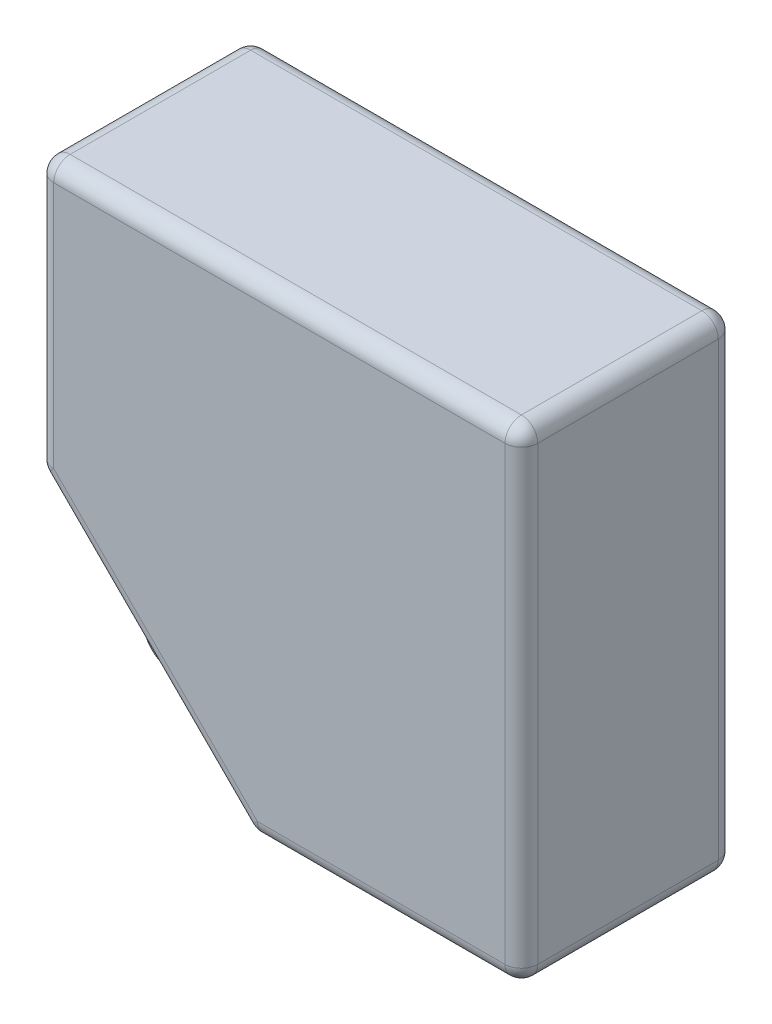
ISO-10303-21;
HEADER;
FILE_DESCRIPTION(('STEP AP214'),'2;1');
FILE_NAME('part.step','',(''),(''),'','','');
FILE_SCHEMA(('AUTOMOTIVE_DESIGN { 1 0 10303 214 1 1 1 1 }'));
ENDSEC;
DATA;
#1=APPLICATION_CONTEXT('core data for automotive mechanical design processes');
#2=APPLICATION_PROTOCOL_DEFINITION('international standard','automotive_design',2000,#1);
#3=PRODUCT_CONTEXT('',#1,'mechanical');
#4=PRODUCT('Part','Part','',(#3));
#5=PRODUCT_RELATED_PRODUCT_CATEGORY('part','',(#4));
#6=PRODUCT_DEFINITION_FORMATION('','',#4);
#7=PRODUCT_DEFINITION_CONTEXT('part definition',#1,'design');
#8=PRODUCT_DEFINITION('design','',#6,#7);
#9=PRODUCT_DEFINITION_SHAPE('','',#8);
#10=(LENGTH_UNIT() NAMED_UNIT(*) SI_UNIT(.MILLI.,.METRE.));
#11=(NAMED_UNIT(*) PLANE_ANGLE_UNIT() SI_UNIT($,.RADIAN.));
#12=(NAMED_UNIT(*) SI_UNIT($,.STERADIAN.) SOLID_ANGLE_UNIT());
#13=UNCERTAINTY_MEASURE_WITH_UNIT(LENGTH_MEASURE(1.E-05),#10,'distance_accuracy_value','');
#14=(GEOMETRIC_REPRESENTATION_CONTEXT(3) GLOBAL_UNCERTAINTY_ASSIGNED_CONTEXT((#13)) GLOBAL_UNIT_ASSIGNED_CONTEXT((#10,
#11,#12)) REPRESENTATION_CONTEXT('',''));
#15=CARTESIAN_POINT('',(0.,0.,0.));
#16=DIRECTION('',(0.,0.,1.));
#17=DIRECTION('',(1.,0.,0.));
#18=AXIS2_PLACEMENT_3D('',#15,#16,#17);
#19=CARTESIAN_POINT('',(-25.3737441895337,-32.5792172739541,26.));
#20=DIRECTION('',(0.707106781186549,0.707106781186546,0.));
#21=DIRECTION('',(-0.707106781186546,0.707106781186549,0.));
#22=AXIS2_PLACEMENT_3D('',#19,#20,#21);
#23=PLANE('',#22);
#24=DIRECTION('',(0.707106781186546,-0.707106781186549,0.));
#25=VECTOR('',#24,1.);
#26=CARTESIAN_POINT('',(-51.3737441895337,-6.57921727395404,24.));
#27=LINE('',#26,#25);
#28=CARTESIAN_POINT('',(-25.9595306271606,-31.9934308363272,24.));
#29=VERTEX_POINT('',#28);
#30=CARTESIAN_POINT('',(-50.7879577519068,-7.16500371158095,24.));
#31=VERTEX_POINT('',#30);
#32=EDGE_CURVE('E203',#29,#31,#27,.F.);
#33=ORIENTED_EDGE('',*,*,#32,.T.);
#34=DIRECTION('',(0.,0.,1.));
#35=VECTOR('',#34,1.);
#36=CARTESIAN_POINT('',(-50.7879577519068,-7.16500371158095,0.));
#37=LINE('',#36,#35);
#38=CARTESIAN_POINT('',(-50.7879577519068,-7.16500371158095,2.));
#39=VERTEX_POINT('',#38);
#40=EDGE_CURVE('E205',#31,#39,#37,.F.);
#41=ORIENTED_EDGE('',*,*,#40,.T.);
#42=DIRECTION('',(-0.707106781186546,0.707106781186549,0.));
#43=VECTOR('',#42,1.);
#44=CARTESIAN_POINT('',(-25.3737441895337,-32.5792172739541,2.));
#45=LINE('',#44,#43);
#46=CARTESIAN_POINT('',(-25.9595306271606,-31.9934308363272,2.));
#47=VERTEX_POINT('',#46);
#48=EDGE_CURVE('E199',#39,#47,#45,.F.);
#49=ORIENTED_EDGE('',*,*,#48,.T.);
#50=DIRECTION('',(0.,0.,-1.));
#51=VECTOR('',#50,1.);
#52=CARTESIAN_POINT('',(-25.9595306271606,-31.9934308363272,26.));
#53=LINE('',#52,#51);
#54=EDGE_CURVE('E201',#47,#29,#53,.F.);
#55=ORIENTED_EDGE('',*,*,#54,.T.);
#56=EDGE_LOOP('',(#33,#41,#49,#55));
#57=FACE_BOUND('',#56,.T.);
#58=CARTESIAN_POINT('',(-38.2368123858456,-19.7161490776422,13.0014424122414));
#59=DIRECTION('',(-0.707106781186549,-0.707106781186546,0.));
#60=DIRECTION('',(0.707106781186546,-0.707106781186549,0.));
#61=AXIS2_PLACEMENT_3D('',#58,#59,#60);
#62=CIRCLE('',#61,5.1);
#63=CARTESIAN_POINT('',(-34.6305678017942,-23.3223936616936,13.0014424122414));
#64=VERTEX_POINT('',#63);
#65=EDGE_CURVE('E589',#64,#64,#62,.T.);
#66=ORIENTED_EDGE('',*,*,#65,.F.);
#67=EDGE_LOOP('',(#66));
#68=FACE_BOUND('',#67,.T.);
#69=ADVANCED_FACE('F29',(#57,#68),#23,.F.);
#70=CARTESIAN_POINT('',(-51.3737441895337,-32.5792172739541,26.));
#71=DIRECTION('',(1.,0.,0.));
#72=DIRECTION('',(0.,0.,-1.));
#73=AXIS2_PLACEMENT_3D('',#70,#71,#72);
#74=PLANE('',#73);
#75=DIRECTION('',(0.,-1.,0.));
#76=VECTOR('',#75,1.);
#77=CARTESIAN_POINT('',(-51.3737441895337,-32.5792172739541,24.));
#78=LINE('',#77,#76);
#79=CARTESIAN_POINT('',(-51.3737441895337,-5.75079014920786,24.));
#80=VERTEX_POINT('',#79);
#81=CARTESIAN_POINT('',(-51.3737441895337,24.4207827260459,24.));
#82=VERTEX_POINT('',#81);
#83=EDGE_CURVE('E194',#80,#82,#78,.F.);
#84=ORIENTED_EDGE('',*,*,#83,.T.);
#85=DIRECTION('',(0.,0.,-1.));
#86=VECTOR('',#85,1.);
#87=CARTESIAN_POINT('',(-51.3737441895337,24.4207827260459,26.));
#88=LINE('',#87,#86);
#89=CARTESIAN_POINT('',(-51.3737441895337,24.4207827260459,2.));
#90=VERTEX_POINT('',#89);
#91=EDGE_CURVE('E196',#82,#90,#88,.T.);
#92=ORIENTED_EDGE('',*,*,#91,.T.);
#93=DIRECTION('',(0.,-1.,0.));
#94=VECTOR('',#93,1.);
#95=CARTESIAN_POINT('',(-51.3737441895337,-6.57921727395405,2.));
#96=LINE('',#95,#94);
#97=CARTESIAN_POINT('',(-51.3737441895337,-5.75079014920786,2.));
#98=VERTEX_POINT('',#97);
#99=EDGE_CURVE('E190',#90,#98,#96,.T.);
#100=ORIENTED_EDGE('',*,*,#99,.T.);
#101=DIRECTION('',(0.,0.,-1.));
#102=VECTOR('',#101,1.);
#103=CARTESIAN_POINT('',(-51.3737441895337,-5.75079014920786,26.));
#104=LINE('',#103,#102);
#105=EDGE_CURVE('E192',#98,#80,#104,.F.);
#106=ORIENTED_EDGE('',*,*,#105,.T.);
#107=EDGE_LOOP('',(#84,#92,#100,#106));
#108=FACE_BOUND('',#107,.T.);
#109=ADVANCED_FACE('F31',(#108),#74,.F.);
#110=CARTESIAN_POINT('',(7.62625581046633,-32.5792172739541,26.));
#111=DIRECTION('',(0.,1.,0.));
#112=DIRECTION('',(-1.,0.,0.));
#113=AXIS2_PLACEMENT_3D('',#110,#111,#112);
#114=PLANE('',#113);
#115=DIRECTION('',(1.,0.,0.));
#116=VECTOR('',#115,1.);
#117=CARTESIAN_POINT('',(7.62625581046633,-32.5792172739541,24.));
#118=LINE('',#117,#116);
#119=CARTESIAN_POINT('',(5.62625581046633,-32.5792172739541,24.));
#120=VERTEX_POINT('',#119);
#121=CARTESIAN_POINT('',(-24.5453170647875,-32.5792172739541,24.));
#122=VERTEX_POINT('',#121);
#123=EDGE_CURVE('E150',#120,#122,#118,.F.);
#124=ORIENTED_EDGE('',*,*,#123,.T.);
#125=DIRECTION('',(0.,0.,1.));
#126=VECTOR('',#125,1.);
#127=CARTESIAN_POINT('',(-24.5453170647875,-32.5792172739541,0.));
#128=LINE('',#127,#126);
#129=CARTESIAN_POINT('',(-24.5453170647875,-32.5792172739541,2.));
#130=VERTEX_POINT('',#129);
#131=EDGE_CURVE('E213',#122,#130,#128,.F.);
#132=ORIENTED_EDGE('',*,*,#131,.T.);
#133=DIRECTION('',(1.,0.,0.));
#134=VECTOR('',#133,1.);
#135=CARTESIAN_POINT('',(7.62625581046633,-32.5792172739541,2.));
#136=LINE('',#135,#134);
#137=CARTESIAN_POINT('',(5.62625581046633,-32.5792172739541,2.));
#138=VERTEX_POINT('',#137);
#139=EDGE_CURVE('E208',#130,#138,#136,.T.);
#140=ORIENTED_EDGE('',*,*,#139,.T.);
#141=DIRECTION('',(0.,0.,-1.));
#142=VECTOR('',#141,1.);
#143=CARTESIAN_POINT('',(5.62625581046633,-32.5792172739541,26.));
#144=LINE('',#143,#142);
#145=EDGE_CURVE('E210',#138,#120,#144,.F.);
#146=ORIENTED_EDGE('',*,*,#145,.T.);
#147=EDGE_LOOP('',(#124,#132,#140,#146));
#148=FACE_BOUND('',#147,.T.);
#149=ADVANCED_FACE('F310',(#148),#114,.F.);
#150=CARTESIAN_POINT('',(7.62625581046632,26.4207827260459,26.));
#151=DIRECTION('',(-1.,0.,0.));
#152=DIRECTION('',(0.,-1.,0.));
#153=AXIS2_PLACEMENT_3D('',#150,#151,#152);
#154=PLANE('',#153);
#155=DIRECTION('',(0.,1.,0.));
#156=VECTOR('',#155,1.);
#157=CARTESIAN_POINT('',(7.62625581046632,26.4207827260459,24.));
#158=LINE('',#157,#156);
#159=CARTESIAN_POINT('',(7.62625581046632,24.4207827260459,24.));
#160=VERTEX_POINT('',#159);
#161=CARTESIAN_POINT('',(7.62625581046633,-30.5792172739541,24.));
#162=VERTEX_POINT('',#161);
#163=EDGE_CURVE('E220',#160,#162,#158,.F.);
#164=ORIENTED_EDGE('',*,*,#163,.T.);
#165=DIRECTION('',(0.,0.,-1.));
#166=VECTOR('',#165,1.);
#167=CARTESIAN_POINT('',(7.62625581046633,-30.5792172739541,26.));
#168=LINE('',#167,#166);
#169=CARTESIAN_POINT('',(7.62625581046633,-30.5792172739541,2.));
#170=VERTEX_POINT('',#169);
#171=EDGE_CURVE('E222',#162,#170,#168,.T.);
#172=ORIENTED_EDGE('',*,*,#171,.T.);
#173=DIRECTION('',(0.,1.,0.));
#174=VECTOR('',#173,1.);
#175=CARTESIAN_POINT('',(7.62625581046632,26.4207827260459,2.));
#176=LINE('',#175,#174);
#177=CARTESIAN_POINT('',(7.62625581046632,24.4207827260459,2.));
#178=VERTEX_POINT('',#177);
#179=EDGE_CURVE('E216',#170,#178,#176,.T.);
#180=ORIENTED_EDGE('',*,*,#179,.T.);
#181=DIRECTION('',(0.,0.,-1.));
#182=VECTOR('',#181,1.);
#183=CARTESIAN_POINT('',(7.62625581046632,24.4207827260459,26.));
#184=LINE('',#183,#182);
#185=EDGE_CURVE('E218',#178,#160,#184,.F.);
#186=ORIENTED_EDGE('',*,*,#185,.T.);
#187=EDGE_LOOP('',(#164,#172,#180,#186));
#188=FACE_BOUND('',#187,.T.);
#189=ADVANCED_FACE('F318',(#188),#154,.F.);
#190=CARTESIAN_POINT('',(-51.3737441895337,26.4207827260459,26.));
#191=DIRECTION('',(0.,-1.,0.));
#192=DIRECTION('',(0.,0.,-1.));
#193=AXIS2_PLACEMENT_3D('',#190,#191,#192);
#194=PLANE('',#193);
#195=DIRECTION('',(0.,0.,-1.));
#196=VECTOR('',#195,1.);
#197=CARTESIAN_POINT('',(-49.3737441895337,26.4207827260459,26.));
#198=LINE('',#197,#196);
#199=CARTESIAN_POINT('',(-49.3737441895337,26.4207827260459,2.));
#200=VERTEX_POINT('',#199);
#201=CARTESIAN_POINT('',(-49.3737441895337,26.4207827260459,24.));
#202=VERTEX_POINT('',#201);
#203=EDGE_CURVE('E185',#200,#202,#198,.F.);
#204=ORIENTED_EDGE('',*,*,#203,.T.);
#205=DIRECTION('',(-1.,0.,0.));
#206=VECTOR('',#205,1.);
#207=CARTESIAN_POINT('',(-51.3737441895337,26.4207827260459,24.));
#208=LINE('',#207,#206);
#209=CARTESIAN_POINT('',(5.62625581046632,26.4207827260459,24.));
#210=VERTEX_POINT('',#209);
#211=EDGE_CURVE('E187',#202,#210,#208,.F.);
#212=ORIENTED_EDGE('',*,*,#211,.T.);
#213=DIRECTION('',(0.,0.,-1.));
#214=VECTOR('',#213,1.);
#215=CARTESIAN_POINT('',(5.62625581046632,26.4207827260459,26.));
#216=LINE('',#215,#214);
#217=CARTESIAN_POINT('',(5.62625581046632,26.4207827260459,2.));
#218=VERTEX_POINT('',#217);
#219=EDGE_CURVE('E183',#210,#218,#216,.T.);
#220=ORIENTED_EDGE('',*,*,#219,.T.);
#221=DIRECTION('',(-1.,0.,0.));
#222=VECTOR('',#221,1.);
#223=CARTESIAN_POINT('',(-51.3737441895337,26.4207827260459,2.));
#224=LINE('',#223,#222);
#225=EDGE_CURVE('E181',#218,#200,#224,.T.);
#226=ORIENTED_EDGE('',*,*,#225,.T.);
#227=EDGE_LOOP('',(#204,#212,#220,#226));
#228=FACE_BOUND('',#227,.T.);
#229=ADVANCED_FACE('F387',(#228),#194,.F.);
#230=CARTESIAN_POINT('',(-51.3737441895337,26.4207827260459,26.));
#231=DIRECTION('',(0.,0.,-1.));
#232=DIRECTION('',(-1.,0.,0.));
#233=AXIS2_PLACEMENT_3D('',#230,#231,#232);
#234=PLANE('',#233);
#235=DIRECTION('',(0.,1.,0.));
#236=VECTOR('',#235,1.);
#237=CARTESIAN_POINT('',(5.62625581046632,26.4207827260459,26.));
#238=LINE('',#237,#236);
#239=CARTESIAN_POINT('',(5.62625581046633,-30.5792172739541,26.));
#240=VERTEX_POINT('',#239);
#241=CARTESIAN_POINT('',(5.62625581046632,24.4207827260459,26.));
#242=VERTEX_POINT('',#241);
#243=EDGE_CURVE('E137',#240,#242,#238,.T.);
#244=ORIENTED_EDGE('',*,*,#243,.T.);
#245=DIRECTION('',(-1.,0.,0.));
#246=VECTOR('',#245,1.);
#247=CARTESIAN_POINT('',(-51.3737441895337,24.4207827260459,26.));
#248=LINE('',#247,#246);
#249=CARTESIAN_POINT('',(-49.3737441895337,24.4207827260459,26.));
#250=VERTEX_POINT('',#249);
#251=EDGE_CURVE('E179',#242,#250,#248,.T.);
#252=ORIENTED_EDGE('',*,*,#251,.T.);
#253=DIRECTION('',(0.,-1.,0.));
#254=VECTOR('',#253,1.);
#255=CARTESIAN_POINT('',(-49.3737441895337,26.4207827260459,26.));
#256=LINE('',#255,#254);
#257=CARTESIAN_POINT('',(-49.3737441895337,-5.75079014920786,26.));
#258=VERTEX_POINT('',#257);
#259=EDGE_CURVE('E177',#250,#258,#256,.T.);
#260=ORIENTED_EDGE('',*,*,#259,.T.);
#261=DIRECTION('',(-0.707106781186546,0.707106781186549,0.));
#262=VECTOR('',#261,1.);
#263=CARTESIAN_POINT('',(-23.9595306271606,-31.165003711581,26.));
#264=LINE('',#263,#262);
#265=CARTESIAN_POINT('',(-24.5453170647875,-30.5792172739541,26.));
#266=VERTEX_POINT('',#265);
#267=EDGE_CURVE('E140',#258,#266,#264,.F.);
#268=ORIENTED_EDGE('',*,*,#267,.T.);
#269=DIRECTION('',(1.,0.,0.));
#270=VECTOR('',#269,1.);
#271=CARTESIAN_POINT('',(-51.3737441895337,-30.5792172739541,26.));
#272=LINE('',#271,#270);
#273=EDGE_CURVE('E132',#266,#240,#272,.T.);
#274=ORIENTED_EDGE('',*,*,#273,.T.);
#275=EDGE_LOOP('',(#244,#252,#260,#268,#274));
#276=FACE_BOUND('',#275,.T.);
#277=ADVANCED_FACE('F134',(#276),#234,.F.);
#278=CARTESIAN_POINT('',(-51.3737441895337,26.4207827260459,0.));
#279=DIRECTION('',(0.,0.,-1.));
#280=DIRECTION('',(-1.,0.,0.));
#281=AXIS2_PLACEMENT_3D('',#278,#279,#280);
#282=PLANE('',#281);
#283=DIRECTION('',(-1.,0.,0.));
#284=VECTOR('',#283,1.);
#285=CARTESIAN_POINT('',(7.62625581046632,24.4207827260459,0.));
#286=LINE('',#285,#284);
#287=CARTESIAN_POINT('',(-49.3737441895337,24.4207827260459,0.));
#288=VERTEX_POINT('',#287);
#289=CARTESIAN_POINT('',(5.62625581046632,24.4207827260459,0.));
#290=VERTEX_POINT('',#289);
#291=EDGE_CURVE('E37',#288,#290,#286,.F.);
#292=ORIENTED_EDGE('',*,*,#291,.T.);
#293=DIRECTION('',(0.,1.,0.));
#294=VECTOR('',#293,1.);
#295=CARTESIAN_POINT('',(5.62625581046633,-32.5792172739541,0.));
#296=LINE('',#295,#294);
#297=CARTESIAN_POINT('',(5.62625581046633,-30.5792172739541,0.));
#298=VERTEX_POINT('',#297);
#299=EDGE_CURVE('E11',#290,#298,#296,.F.);
#300=ORIENTED_EDGE('',*,*,#299,.T.);
#301=DIRECTION('',(1.,0.,0.));
#302=VECTOR('',#301,1.);
#303=CARTESIAN_POINT('',(-25.3737441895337,-30.5792172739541,0.));
#304=LINE('',#303,#302);
#305=CARTESIAN_POINT('',(-24.5453170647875,-30.5792172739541,0.));
#306=VERTEX_POINT('',#305);
#307=EDGE_CURVE('E225',#298,#306,#304,.F.);
#308=ORIENTED_EDGE('',*,*,#307,.T.);
#309=DIRECTION('',(0.707106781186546,-0.707106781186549,0.));
#310=VECTOR('',#309,1.);
#311=CARTESIAN_POINT('',(-66.4595306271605,11.3349962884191,0.));
#312=LINE('',#311,#310);
#313=CARTESIAN_POINT('',(-49.3737441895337,-5.75079014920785,0.));
#314=VERTEX_POINT('',#313);
#315=EDGE_CURVE('E227',#306,#314,#312,.F.);
#316=ORIENTED_EDGE('',*,*,#315,.T.);
#317=DIRECTION('',(0.,-1.,0.));
#318=VECTOR('',#317,1.);
#319=CARTESIAN_POINT('',(-49.3737441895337,26.4207827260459,0.));
#320=LINE('',#319,#318);
#321=EDGE_CURVE('E47',#314,#288,#320,.F.);
#322=ORIENTED_EDGE('',*,*,#321,.T.);
#323=EDGE_LOOP('',(#292,#300,#308,#316,#322));
#324=FACE_BOUND('',#323,.T.);
#325=ADVANCED_FACE('F231',(#324),#282,.T.);
#326=CARTESIAN_POINT('',(-24.5453170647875,-30.5792172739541,2.));
#327=DIRECTION('',(0.,0.,1.));
#328=DIRECTION('',(1.,0.,0.));
#329=AXIS2_PLACEMENT_3D('',#326,#327,#328);
#330=SPHERICAL_SURFACE('',#329,2.);
#331=CARTESIAN_POINT('',(-24.5453170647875,-30.5792172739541,2.));
#332=DIRECTION('',(0.707106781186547,-0.707106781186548,0.));
#333=DIRECTION('',(0.707106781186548,0.707106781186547,0.));
#334=AXIS2_PLACEMENT_3D('',#331,#332,#333);
#335=CIRCLE('',#334,2.);
#336=EDGE_CURVE('E298',#306,#47,#335,.F.);
#337=ORIENTED_EDGE('',*,*,#336,.F.);
#338=CARTESIAN_POINT('',(-24.5453170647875,-30.5792172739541,2.));
#339=DIRECTION('',(-1.,0.,0.));
#340=DIRECTION('',(0.,-1.,0.));
#341=AXIS2_PLACEMENT_3D('',#338,#339,#340);
#342=CIRCLE('',#341,2.);
#343=EDGE_CURVE('E169',#130,#306,#342,.F.);
#344=ORIENTED_EDGE('',*,*,#343,.F.);
#345=CARTESIAN_POINT('',(-24.5453170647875,-30.5792172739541,2.));
#346=DIRECTION('',(0.,0.,-1.));
#347=DIRECTION('',(-1.,0.,0.));
#348=AXIS2_PLACEMENT_3D('',#345,#346,#347);
#349=CIRCLE('',#348,2.);
#350=EDGE_CURVE('E172',#47,#130,#349,.F.);
#351=ORIENTED_EDGE('',*,*,#350,.F.);
#352=EDGE_LOOP('',(#337,#344,#351));
#353=FACE_BOUND('',#352,.T.);
#354=ADVANCED_FACE('F381',(#353),#330,.T.);
#355=CARTESIAN_POINT('',(7.62625581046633,-30.5792172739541,2.));
#356=DIRECTION('',(-1.,0.,0.));
#357=DIRECTION('',(0.,-1.,0.));
#358=AXIS2_PLACEMENT_3D('',#355,#356,#357);
#359=CYLINDRICAL_SURFACE('',#358,2.);
#360=ORIENTED_EDGE('',*,*,#343,.T.);
#361=ORIENTED_EDGE('',*,*,#307,.F.);
#362=CARTESIAN_POINT('',(5.62625581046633,-30.5792172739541,2.));
#363=DIRECTION('',(1.,0.,0.));
#364=DIRECTION('',(0.,0.,-1.));
#365=AXIS2_PLACEMENT_3D('',#362,#363,#364);
#366=CIRCLE('',#365,2.);
#367=EDGE_CURVE('E295',#138,#298,#366,.T.);
#368=ORIENTED_EDGE('',*,*,#367,.F.);
#369=ORIENTED_EDGE('',*,*,#139,.F.);
#370=EDGE_LOOP('',(#360,#361,#368,#369));
#371=FACE_BOUND('',#370,.T.);
#372=ADVANCED_FACE('F419',(#371),#359,.T.);
#373=CARTESIAN_POINT('',(-24.5453170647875,-30.5792172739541,26.));
#374=DIRECTION('',(0.,0.,-1.));
#375=DIRECTION('',(-1.,0.,0.));
#376=AXIS2_PLACEMENT_3D('',#373,#374,#375);
#377=CYLINDRICAL_SURFACE('',#376,2.);
#378=ORIENTED_EDGE('',*,*,#350,.T.);
#379=ORIENTED_EDGE('',*,*,#131,.F.);
#380=CARTESIAN_POINT('',(-24.5453170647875,-30.5792172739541,24.));
#381=DIRECTION('',(0.,0.,1.));
#382=DIRECTION('',(1.,0.,0.));
#383=AXIS2_PLACEMENT_3D('',#380,#381,#382);
#384=CIRCLE('',#383,2.);
#385=EDGE_CURVE('E242',#29,#122,#384,.T.);
#386=ORIENTED_EDGE('',*,*,#385,.F.);
#387=ORIENTED_EDGE('',*,*,#54,.F.);
#388=EDGE_LOOP('',(#378,#379,#386,#387));
#389=FACE_BOUND('',#388,.T.);
#390=ADVANCED_FACE('F304',(#389),#377,.T.);
#391=CARTESIAN_POINT('',(-66.4595306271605,11.3349962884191,2.));
#392=DIRECTION('',(0.707106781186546,-0.707106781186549,0.));
#393=DIRECTION('',(0.707106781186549,0.707106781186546,0.));
#394=AXIS2_PLACEMENT_3D('',#391,#392,#393);
#395=CYLINDRICAL_SURFACE('',#394,2.);
#396=ORIENTED_EDGE('',*,*,#336,.T.);
#397=ORIENTED_EDGE('',*,*,#48,.F.);
#398=CARTESIAN_POINT('',(-49.3737441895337,-5.75079014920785,2.));
#399=DIRECTION('',(-0.707106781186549,0.707106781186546,0.));
#400=DIRECTION('',(-0.707106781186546,-0.707106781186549,0.));
#401=AXIS2_PLACEMENT_3D('',#398,#399,#400);
#402=CIRCLE('',#401,2.);
#403=EDGE_CURVE('E237',#314,#39,#402,.T.);
#404=ORIENTED_EDGE('',*,*,#403,.F.);
#405=ORIENTED_EDGE('',*,*,#315,.F.);
#406=EDGE_LOOP('',(#396,#397,#404,#405));
#407=FACE_BOUND('',#406,.T.);
#408=ADVANCED_FACE('F239',(#407),#395,.T.);
#409=CARTESIAN_POINT('',(5.62625581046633,-30.5792172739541,2.));
#410=DIRECTION('',(0.,0.,1.));
#411=DIRECTION('',(1.,0.,0.));
#412=AXIS2_PLACEMENT_3D('',#409,#410,#411);
#413=SPHERICAL_SURFACE('',#412,2.);
#414=CARTESIAN_POINT('',(5.62625581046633,-30.5792172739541,2.));
#415=DIRECTION('',(0.,0.,-1.));
#416=DIRECTION('',(-1.,0.,0.));
#417=AXIS2_PLACEMENT_3D('',#414,#415,#416);
#418=CIRCLE('',#417,2.);
#419=EDGE_CURVE('E289',#138,#170,#418,.F.);
#420=ORIENTED_EDGE('',*,*,#419,.F.);
#421=ORIENTED_EDGE('',*,*,#367,.T.);
#422=CARTESIAN_POINT('',(5.62625581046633,-30.5792172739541,2.));
#423=DIRECTION('',(0.,-1.,0.));
#424=DIRECTION('',(0.,0.,-1.));
#425=AXIS2_PLACEMENT_3D('',#422,#423,#424);
#426=CIRCLE('',#425,2.);
#427=EDGE_CURVE('E243',#170,#298,#426,.F.);
#428=ORIENTED_EDGE('',*,*,#427,.F.);
#429=EDGE_LOOP('',(#420,#421,#428));
#430=FACE_BOUND('',#429,.T.);
#431=ADVANCED_FACE('F359',(#430),#413,.T.);
#432=CARTESIAN_POINT('',(-24.5453170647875,-30.5792172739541,24.));
#433=DIRECTION('',(0.,0.,1.));
#434=DIRECTION('',(1.,0.,0.));
#435=AXIS2_PLACEMENT_3D('',#432,#433,#434);
#436=SPHERICAL_SURFACE('',#435,2.);
#437=CARTESIAN_POINT('',(-24.5453170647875,-30.5792172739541,24.));
#438=DIRECTION('',(0.707106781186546,-0.707106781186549,0.));
#439=DIRECTION('',(0.707106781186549,0.707106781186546,0.));
#440=AXIS2_PLACEMENT_3D('',#437,#438,#439);
#441=CIRCLE('',#440,2.);
#442=EDGE_CURVE('E285',#29,#266,#441,.F.);
#443=ORIENTED_EDGE('',*,*,#442,.F.);
#444=ORIENTED_EDGE('',*,*,#385,.T.);
#445=CARTESIAN_POINT('',(-24.5453170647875,-30.5792172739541,24.));
#446=DIRECTION('',(-1.,0.,0.));
#447=DIRECTION('',(0.,0.,1.));
#448=AXIS2_PLACEMENT_3D('',#445,#446,#447);
#449=CIRCLE('',#448,2.);
#450=EDGE_CURVE('E287',#266,#122,#449,.F.);
#451=ORIENTED_EDGE('',*,*,#450,.F.);
#452=EDGE_LOOP('',(#443,#444,#451));
#453=FACE_BOUND('',#452,.T.);
#454=ADVANCED_FACE('F357',(#453),#436,.T.);
#455=CARTESIAN_POINT('',(-49.3737441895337,-5.75079014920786,2.));
#456=DIRECTION('',(0.,0.,1.));
#457=DIRECTION('',(1.,0.,0.));
#458=AXIS2_PLACEMENT_3D('',#455,#456,#457);
#459=SPHERICAL_SURFACE('',#458,2.);
#460=CARTESIAN_POINT('',(-49.3737441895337,-5.75079014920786,2.));
#461=DIRECTION('',(0.,-1.,0.));
#462=DIRECTION('',(0.,0.,-1.));
#463=AXIS2_PLACEMENT_3D('',#460,#461,#462);
#464=CIRCLE('',#463,2.);
#465=EDGE_CURVE('E246',#314,#98,#464,.F.);
#466=ORIENTED_EDGE('',*,*,#465,.F.);
#467=ORIENTED_EDGE('',*,*,#403,.T.);
#468=CARTESIAN_POINT('',(-49.3737441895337,-5.75079014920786,2.));
#469=DIRECTION('',(0.,0.,-1.));
#470=DIRECTION('',(0.,1.,0.));
#471=AXIS2_PLACEMENT_3D('',#468,#469,#470);
#472=CIRCLE('',#471,2.);
#473=EDGE_CURVE('E248',#98,#39,#472,.F.);
#474=ORIENTED_EDGE('',*,*,#473,.F.);
#475=EDGE_LOOP('',(#466,#467,#474));
#476=FACE_BOUND('',#475,.T.);
#477=ADVANCED_FACE('F247',(#476),#459,.T.);
#478=CARTESIAN_POINT('',(5.62625581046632,26.4207827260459,2.));
#479=DIRECTION('',(0.,-1.,0.));
#480=DIRECTION('',(1.,0.,0.));
#481=AXIS2_PLACEMENT_3D('',#478,#479,#480);
#482=CYLINDRICAL_SURFACE('',#481,2.);
#483=ORIENTED_EDGE('',*,*,#427,.T.);
#484=ORIENTED_EDGE('',*,*,#299,.F.);
#485=CARTESIAN_POINT('',(5.62625581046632,24.4207827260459,2.));
#486=DIRECTION('',(0.,1.,0.));
#487=DIRECTION('',(0.,0.,1.));
#488=AXIS2_PLACEMENT_3D('',#485,#486,#487);
#489=CIRCLE('',#488,2.);
#490=EDGE_CURVE('E279',#178,#290,#489,.T.);
#491=ORIENTED_EDGE('',*,*,#490,.F.);
#492=ORIENTED_EDGE('',*,*,#179,.F.);
#493=EDGE_LOOP('',(#483,#484,#491,#492));
#494=FACE_BOUND('',#493,.T.);
#495=ADVANCED_FACE('F365',(#494),#482,.T.);
#496=CARTESIAN_POINT('',(5.62625581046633,-30.5792172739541,26.));
#497=DIRECTION('',(0.,0.,-1.));
#498=DIRECTION('',(-1.,0.,0.));
#499=AXIS2_PLACEMENT_3D('',#496,#497,#498);
#500=CYLINDRICAL_SURFACE('',#499,2.);
#501=ORIENTED_EDGE('',*,*,#419,.T.);
#502=ORIENTED_EDGE('',*,*,#171,.F.);
#503=CARTESIAN_POINT('',(5.62625581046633,-30.5792172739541,24.));
#504=DIRECTION('',(0.,0.,1.));
#505=DIRECTION('',(1.,0.,0.));
#506=AXIS2_PLACEMENT_3D('',#503,#504,#505);
#507=CIRCLE('',#506,2.);
#508=EDGE_CURVE('E154',#120,#162,#507,.T.);
#509=ORIENTED_EDGE('',*,*,#508,.F.);
#510=ORIENTED_EDGE('',*,*,#145,.F.);
#511=EDGE_LOOP('',(#501,#502,#509,#510));
#512=FACE_BOUND('',#511,.T.);
#513=ADVANCED_FACE('F314',(#512),#500,.T.);
#514=CARTESIAN_POINT('',(-51.3737441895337,-30.5792172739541,24.));
#515=DIRECTION('',(1.,0.,0.));
#516=DIRECTION('',(0.,1.,0.));
#517=AXIS2_PLACEMENT_3D('',#514,#515,#516);
#518=CYLINDRICAL_SURFACE('',#517,2.);
#519=ORIENTED_EDGE('',*,*,#450,.T.);
#520=ORIENTED_EDGE('',*,*,#123,.F.);
#521=CARTESIAN_POINT('',(5.62625581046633,-30.5792172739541,24.));
#522=DIRECTION('',(1.,0.,0.));
#523=DIRECTION('',(0.,1.,0.));
#524=AXIS2_PLACEMENT_3D('',#521,#522,#523);
#525=CIRCLE('',#524,2.);
#526=EDGE_CURVE('E147',#240,#120,#525,.T.);
#527=ORIENTED_EDGE('',*,*,#526,.F.);
#528=ORIENTED_EDGE('',*,*,#273,.F.);
#529=EDGE_LOOP('',(#519,#520,#527,#528));
#530=FACE_BOUND('',#529,.T.);
#531=ADVANCED_FACE('F149',(#530),#518,.T.);
#532=CARTESIAN_POINT('',(-66.4595306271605,11.3349962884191,24.));
#533=DIRECTION('',(0.707106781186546,-0.707106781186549,0.));
#534=DIRECTION('',(0.707106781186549,0.707106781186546,0.));
#535=AXIS2_PLACEMENT_3D('',#532,#533,#534);
#536=CYLINDRICAL_SURFACE('',#535,2.);
#537=ORIENTED_EDGE('',*,*,#442,.T.);
#538=ORIENTED_EDGE('',*,*,#267,.F.);
#539=CARTESIAN_POINT('',(-49.3737441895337,-5.75079014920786,24.));
#540=DIRECTION('',(-0.707106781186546,0.707106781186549,0.));
#541=DIRECTION('',(-0.707106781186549,-0.707106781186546,0.));
#542=AXIS2_PLACEMENT_3D('',#539,#540,#541);
#543=CIRCLE('',#542,2.);
#544=EDGE_CURVE('E155',#31,#258,#543,.T.);
#545=ORIENTED_EDGE('',*,*,#544,.F.);
#546=ORIENTED_EDGE('',*,*,#32,.F.);
#547=EDGE_LOOP('',(#537,#538,#545,#546));
#548=FACE_BOUND('',#547,.T.);
#549=ADVANCED_FACE('F353',(#548),#536,.T.);
#550=CARTESIAN_POINT('',(-49.3737441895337,-5.75079014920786,26.));
#551=DIRECTION('',(0.,0.,1.));
#552=DIRECTION('',(1.,0.,0.));
#553=AXIS2_PLACEMENT_3D('',#550,#551,#552);
#554=CYLINDRICAL_SURFACE('',#553,2.);
#555=ORIENTED_EDGE('',*,*,#473,.T.);
#556=ORIENTED_EDGE('',*,*,#40,.F.);
#557=CARTESIAN_POINT('',(-49.3737441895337,-5.75079014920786,24.));
#558=DIRECTION('',(0.,0.,1.));
#559=DIRECTION('',(1.,0.,0.));
#560=AXIS2_PLACEMENT_3D('',#557,#558,#559);
#561=CIRCLE('',#560,2.);
#562=EDGE_CURVE('E261',#80,#31,#561,.T.);
#563=ORIENTED_EDGE('',*,*,#562,.F.);
#564=ORIENTED_EDGE('',*,*,#105,.F.);
#565=EDGE_LOOP('',(#555,#556,#563,#564));
#566=FACE_BOUND('',#565,.T.);
#567=ADVANCED_FACE('F473',(#566),#554,.T.);
#568=CARTESIAN_POINT('',(-49.3737441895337,-32.5792172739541,2.));
#569=DIRECTION('',(0.,1.,0.));
#570=DIRECTION('',(0.,0.,1.));
#571=AXIS2_PLACEMENT_3D('',#568,#569,#570);
#572=CYLINDRICAL_SURFACE('',#571,2.);
#573=ORIENTED_EDGE('',*,*,#465,.T.);
#574=ORIENTED_EDGE('',*,*,#99,.F.);
#575=CARTESIAN_POINT('',(-49.3737441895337,24.4207827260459,2.));
#576=DIRECTION('',(0.,1.,0.));
#577=DIRECTION('',(-1.,0.,0.));
#578=AXIS2_PLACEMENT_3D('',#575,#576,#577);
#579=CIRCLE('',#578,2.);
#580=EDGE_CURVE('E257',#288,#90,#579,.T.);
#581=ORIENTED_EDGE('',*,*,#580,.F.);
#582=ORIENTED_EDGE('',*,*,#321,.F.);
#583=EDGE_LOOP('',(#573,#574,#581,#582));
#584=FACE_BOUND('',#583,.T.);
#585=ADVANCED_FACE('F255',(#584),#572,.T.);
#586=CARTESIAN_POINT('',(-51.3737441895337,24.4207827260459,2.));
#587=DIRECTION('',(1.,0.,0.));
#588=DIRECTION('',(0.,0.,-1.));
#589=AXIS2_PLACEMENT_3D('',#586,#587,#588);
#590=CYLINDRICAL_SURFACE('',#589,2.);
#591=CARTESIAN_POINT('',(5.62625581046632,24.4207827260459,2.));
#592=DIRECTION('',(1.,0.,0.));
#593=DIRECTION('',(0.,1.,0.));
#594=AXIS2_PLACEMENT_3D('',#591,#592,#593);
#595=CIRCLE('',#594,2.);
#596=EDGE_CURVE('E252',#290,#218,#595,.T.);
#597=ORIENTED_EDGE('',*,*,#596,.F.);
#598=ORIENTED_EDGE('',*,*,#291,.F.);
#599=CARTESIAN_POINT('',(-49.3737441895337,24.4207827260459,2.));
#600=DIRECTION('',(-1.,0.,0.));
#601=DIRECTION('',(0.,0.,1.));
#602=AXIS2_PLACEMENT_3D('',#599,#600,#601);
#603=CIRCLE('',#602,2.);
#604=EDGE_CURVE('E262',#200,#288,#603,.T.);
#605=ORIENTED_EDGE('',*,*,#604,.F.);
#606=ORIENTED_EDGE('',*,*,#225,.F.);
#607=EDGE_LOOP('',(#597,#598,#605,#606));
#608=FACE_BOUND('',#607,.T.);
#609=ADVANCED_FACE('F487',(#608),#590,.T.);
#610=CARTESIAN_POINT('',(5.62625581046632,24.4207827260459,2.));
#611=DIRECTION('',(0.,0.,1.));
#612=DIRECTION('',(1.,0.,0.));
#613=AXIS2_PLACEMENT_3D('',#610,#611,#612);
#614=SPHERICAL_SURFACE('',#613,2.);
#615=ORIENTED_EDGE('',*,*,#490,.T.);
#616=ORIENTED_EDGE('',*,*,#596,.T.);
#617=CARTESIAN_POINT('',(5.62625581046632,24.4207827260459,2.));
#618=DIRECTION('',(0.,0.,-1.));
#619=DIRECTION('',(-1.,0.,0.));
#620=AXIS2_PLACEMENT_3D('',#617,#618,#619);
#621=CIRCLE('',#620,2.);
#622=EDGE_CURVE('E162',#178,#218,#621,.F.);
#623=ORIENTED_EDGE('',*,*,#622,.F.);
#624=EDGE_LOOP('',(#615,#616,#623));
#625=FACE_BOUND('',#624,.T.);
#626=ADVANCED_FACE('F494',(#625),#614,.T.);
#627=CARTESIAN_POINT('',(5.62625581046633,-30.5792172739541,24.));
#628=DIRECTION('',(0.,0.,1.));
#629=DIRECTION('',(1.,0.,0.));
#630=AXIS2_PLACEMENT_3D('',#627,#628,#629);
#631=SPHERICAL_SURFACE('',#630,2.);
#632=ORIENTED_EDGE('',*,*,#526,.T.);
#633=ORIENTED_EDGE('',*,*,#508,.T.);
#634=CARTESIAN_POINT('',(5.62625581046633,-30.5792172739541,24.));
#635=DIRECTION('',(0.,-1.,0.));
#636=DIRECTION('',(0.,0.,-1.));
#637=AXIS2_PLACEMENT_3D('',#634,#635,#636);
#638=CIRCLE('',#637,2.);
#639=EDGE_CURVE('E158',#240,#162,#638,.F.);
#640=ORIENTED_EDGE('',*,*,#639,.F.);
#641=EDGE_LOOP('',(#632,#633,#640));
#642=FACE_BOUND('',#641,.T.);
#643=ADVANCED_FACE('F159',(#642),#631,.T.);
#644=CARTESIAN_POINT('',(-49.3737441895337,-5.75079014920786,24.));
#645=DIRECTION('',(0.,0.,1.));
#646=DIRECTION('',(1.,0.,0.));
#647=AXIS2_PLACEMENT_3D('',#644,#645,#646);
#648=SPHERICAL_SURFACE('',#647,2.);
#649=ORIENTED_EDGE('',*,*,#562,.T.);
#650=ORIENTED_EDGE('',*,*,#544,.T.);
#651=CARTESIAN_POINT('',(-49.3737441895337,-5.75079014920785,24.));
#652=DIRECTION('',(0.,-1.,0.));
#653=DIRECTION('',(1.,0.,0.));
#654=AXIS2_PLACEMENT_3D('',#651,#652,#653);
#655=CIRCLE('',#654,2.);
#656=EDGE_CURVE('E163',#80,#258,#655,.F.);
#657=ORIENTED_EDGE('',*,*,#656,.F.);
#658=EDGE_LOOP('',(#649,#650,#657));
#659=FACE_BOUND('',#658,.T.);
#660=ADVANCED_FACE('F348',(#659),#648,.T.);
#661=CARTESIAN_POINT('',(-49.3737441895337,24.4207827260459,2.));
#662=DIRECTION('',(0.,0.,1.));
#663=DIRECTION('',(1.,0.,0.));
#664=AXIS2_PLACEMENT_3D('',#661,#662,#663);
#665=SPHERICAL_SURFACE('',#664,2.);
#666=ORIENTED_EDGE('',*,*,#604,.T.);
#667=ORIENTED_EDGE('',*,*,#580,.T.);
#668=CARTESIAN_POINT('',(-49.3737441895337,24.4207827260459,2.));
#669=DIRECTION('',(0.,0.,-1.));
#670=DIRECTION('',(-1.,0.,0.));
#671=AXIS2_PLACEMENT_3D('',#668,#669,#670);
#672=CIRCLE('',#671,2.);
#673=EDGE_CURVE('E266',#200,#90,#672,.F.);
#674=ORIENTED_EDGE('',*,*,#673,.F.);
#675=EDGE_LOOP('',(#666,#667,#674));
#676=FACE_BOUND('',#675,.T.);
#677=ADVANCED_FACE('F265',(#676),#665,.T.);
#678=CARTESIAN_POINT('',(5.62625581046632,24.4207827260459,26.));
#679=DIRECTION('',(0.,0.,-1.));
#680=DIRECTION('',(-1.,0.,0.));
#681=AXIS2_PLACEMENT_3D('',#678,#679,#680);
#682=CYLINDRICAL_SURFACE('',#681,2.);
#683=ORIENTED_EDGE('',*,*,#622,.T.);
#684=ORIENTED_EDGE('',*,*,#219,.F.);
#685=CARTESIAN_POINT('',(5.62625581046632,24.4207827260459,24.));
#686=DIRECTION('',(0.,0.,1.));
#687=DIRECTION('',(1.,0.,0.));
#688=AXIS2_PLACEMENT_3D('',#685,#686,#687);
#689=CIRCLE('',#688,2.);
#690=EDGE_CURVE('E325',#160,#210,#689,.T.);
#691=ORIENTED_EDGE('',*,*,#690,.F.);
#692=ORIENTED_EDGE('',*,*,#185,.F.);
#693=EDGE_LOOP('',(#683,#684,#691,#692));
#694=FACE_BOUND('',#693,.T.);
#695=ADVANCED_FACE('F326',(#694),#682,.T.);
#696=CARTESIAN_POINT('',(5.62625581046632,26.4207827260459,24.));
#697=DIRECTION('',(0.,1.,0.));
#698=DIRECTION('',(-1.,0.,0.));
#699=AXIS2_PLACEMENT_3D('',#696,#697,#698);
#700=CYLINDRICAL_SURFACE('',#699,2.);
#701=ORIENTED_EDGE('',*,*,#639,.T.);
#702=ORIENTED_EDGE('',*,*,#163,.F.);
#703=CARTESIAN_POINT('',(5.62625581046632,24.4207827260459,24.));
#704=DIRECTION('',(0.,1.,0.));
#705=DIRECTION('',(0.,0.,1.));
#706=AXIS2_PLACEMENT_3D('',#703,#704,#705);
#707=CIRCLE('',#706,2.);
#708=EDGE_CURVE('E167',#242,#160,#707,.T.);
#709=ORIENTED_EDGE('',*,*,#708,.F.);
#710=ORIENTED_EDGE('',*,*,#243,.F.);
#711=EDGE_LOOP('',(#701,#702,#709,#710));
#712=FACE_BOUND('',#711,.T.);
#713=ADVANCED_FACE('F165',(#712),#700,.T.);
#714=CARTESIAN_POINT('',(-49.3737441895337,26.4207827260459,24.));
#715=DIRECTION('',(0.,-1.,0.));
#716=DIRECTION('',(0.,0.,-1.));
#717=AXIS2_PLACEMENT_3D('',#714,#715,#716);
#718=CYLINDRICAL_SURFACE('',#717,2.);
#719=ORIENTED_EDGE('',*,*,#656,.T.);
#720=ORIENTED_EDGE('',*,*,#259,.F.);
#721=CARTESIAN_POINT('',(-49.3737441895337,24.4207827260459,24.));
#722=DIRECTION('',(0.,1.,0.));
#723=DIRECTION('',(0.,0.,1.));
#724=AXIS2_PLACEMENT_3D('',#721,#722,#723);
#725=CIRCLE('',#724,2.);
#726=EDGE_CURVE('E332',#82,#250,#725,.T.);
#727=ORIENTED_EDGE('',*,*,#726,.F.);
#728=ORIENTED_EDGE('',*,*,#83,.F.);
#729=EDGE_LOOP('',(#719,#720,#727,#728));
#730=FACE_BOUND('',#729,.T.);
#731=ADVANCED_FACE('F345',(#730),#718,.T.);
#732=CARTESIAN_POINT('',(-49.3737441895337,24.4207827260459,26.));
#733=DIRECTION('',(0.,0.,-1.));
#734=DIRECTION('',(-1.,0.,0.));
#735=AXIS2_PLACEMENT_3D('',#732,#733,#734);
#736=CYLINDRICAL_SURFACE('',#735,2.);
#737=ORIENTED_EDGE('',*,*,#673,.T.);
#738=ORIENTED_EDGE('',*,*,#91,.F.);
#739=CARTESIAN_POINT('',(-49.3737441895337,24.4207827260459,24.));
#740=DIRECTION('',(0.,0.,1.));
#741=DIRECTION('',(1.,0.,0.));
#742=AXIS2_PLACEMENT_3D('',#739,#740,#741);
#743=CIRCLE('',#742,2.);
#744=EDGE_CURVE('E335',#202,#82,#743,.T.);
#745=ORIENTED_EDGE('',*,*,#744,.F.);
#746=ORIENTED_EDGE('',*,*,#203,.F.);
#747=EDGE_LOOP('',(#737,#738,#745,#746));
#748=FACE_BOUND('',#747,.T.);
#749=ADVANCED_FACE('F538',(#748),#736,.T.);
#750=CARTESIAN_POINT('',(5.62625581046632,24.4207827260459,24.));
#751=DIRECTION('',(0.,0.,1.));
#752=DIRECTION('',(1.,0.,0.));
#753=AXIS2_PLACEMENT_3D('',#750,#751,#752);
#754=SPHERICAL_SURFACE('',#753,2.);
#755=ORIENTED_EDGE('',*,*,#708,.T.);
#756=ORIENTED_EDGE('',*,*,#690,.T.);
#757=CARTESIAN_POINT('',(5.62625581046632,24.4207827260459,24.));
#758=DIRECTION('',(1.,0.,0.));
#759=DIRECTION('',(0.,0.,-1.));
#760=AXIS2_PLACEMENT_3D('',#757,#758,#759);
#761=CIRCLE('',#760,2.);
#762=EDGE_CURVE('E330',#242,#210,#761,.F.);
#763=ORIENTED_EDGE('',*,*,#762,.F.);
#764=EDGE_LOOP('',(#755,#756,#763));
#765=FACE_BOUND('',#764,.T.);
#766=ADVANCED_FACE('F329',(#765),#754,.T.);
#767=CARTESIAN_POINT('',(-49.3737441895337,24.4207827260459,24.));
#768=DIRECTION('',(0.,0.,1.));
#769=DIRECTION('',(1.,0.,0.));
#770=AXIS2_PLACEMENT_3D('',#767,#768,#769);
#771=SPHERICAL_SURFACE('',#770,2.);
#772=ORIENTED_EDGE('',*,*,#744,.T.);
#773=ORIENTED_EDGE('',*,*,#726,.T.);
#774=CARTESIAN_POINT('',(-49.3737441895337,24.4207827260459,24.));
#775=DIRECTION('',(-1.,0.,0.));
#776=DIRECTION('',(0.,0.,1.));
#777=AXIS2_PLACEMENT_3D('',#774,#775,#776);
#778=CIRCLE('',#777,2.);
#779=EDGE_CURVE('E588',#202,#250,#778,.F.);
#780=ORIENTED_EDGE('',*,*,#779,.F.);
#781=EDGE_LOOP('',(#772,#773,#780));
#782=FACE_BOUND('',#781,.T.);
#783=ADVANCED_FACE('F552',(#782),#771,.T.);
#784=CARTESIAN_POINT('',(-51.3737441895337,24.4207827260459,24.));
#785=DIRECTION('',(-1.,0.,0.));
#786=DIRECTION('',(0.,0.,1.));
#787=AXIS2_PLACEMENT_3D('',#784,#785,#786);
#788=CYLINDRICAL_SURFACE('',#787,2.);
#789=ORIENTED_EDGE('',*,*,#762,.T.);
#790=ORIENTED_EDGE('',*,*,#211,.F.);
#791=ORIENTED_EDGE('',*,*,#779,.T.);
#792=ORIENTED_EDGE('',*,*,#251,.F.);
#793=EDGE_LOOP('',(#789,#790,#791,#792));
#794=FACE_BOUND('',#793,.T.);
#795=ADVANCED_FACE('F559',(#794),#788,.T.);
#796=CARTESIAN_POINT('',(-45.3078801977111,-26.7872168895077,13.0014424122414));
#797=DIRECTION('',(0.707106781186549,0.707106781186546,0.));
#798=DIRECTION('',(-0.707106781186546,0.707106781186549,0.));
#799=AXIS2_PLACEMENT_3D('',#796,#797,#798);
#800=CYLINDRICAL_SURFACE('',#799,5.1);
#801=CARTESIAN_POINT('',(-45.3078801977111,-26.7872168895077,13.0014424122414));
#802=DIRECTION('',(-0.707106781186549,-0.707106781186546,0.));
#803=DIRECTION('',(0.707106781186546,-0.707106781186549,0.));
#804=AXIS2_PLACEMENT_3D('',#801,#802,#803);
#805=CIRCLE('',#804,5.1);
#806=CARTESIAN_POINT('',(-41.7016356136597,-30.3934614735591,13.0014424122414));
#807=VERTEX_POINT('',#806);
#808=EDGE_CURVE('E587',#807,#807,#805,.T.);
#809=ORIENTED_EDGE('',*,*,#808,.F.);
#810=EDGE_LOOP('',(#809));
#811=FACE_BOUND('',#810,.T.);
#812=ORIENTED_EDGE('',*,*,#65,.T.);
#813=EDGE_LOOP('',(#812));
#814=FACE_BOUND('',#813,.T.);
#815=ADVANCED_FACE('F565',(#811,#814),#800,.T.);
#816=CARTESIAN_POINT('',(-45.3078801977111,-26.7872168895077,13.0014424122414));
#817=DIRECTION('',(-0.707106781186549,-0.707106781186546,0.));
#818=DIRECTION('',(0.707106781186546,-0.707106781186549,0.));
#819=AXIS2_PLACEMENT_3D('',#816,#817,#818);
#820=PLANE('',#819);
#821=ORIENTED_EDGE('',*,*,#808,.T.);
#822=EDGE_LOOP('',(#821));
#823=FACE_BOUND('',#822,.T.);
#824=ADVANCED_FACE('F575',(#823),#820,.T.);
#825=CLOSED_SHELL('',(#69,#109,#149,#189,#229,#277,#325,#354,#372,#390,#408,#431,#454,#477,#495,
#513,#531,#549,#567,#585,#609,#626,#643,#660,#677,#695,#713,#731,#749,#766,#783,#795,#815,#824));
#826=MANIFOLD_SOLID_BREP('B2',#825);
#827=ADVANCED_BREP_SHAPE_REPRESENTATION('',(#18,#826),#14);
#828=SHAPE_DEFINITION_REPRESENTATION(#9,#827);
ENDSEC;
END-ISO-10303-21;
